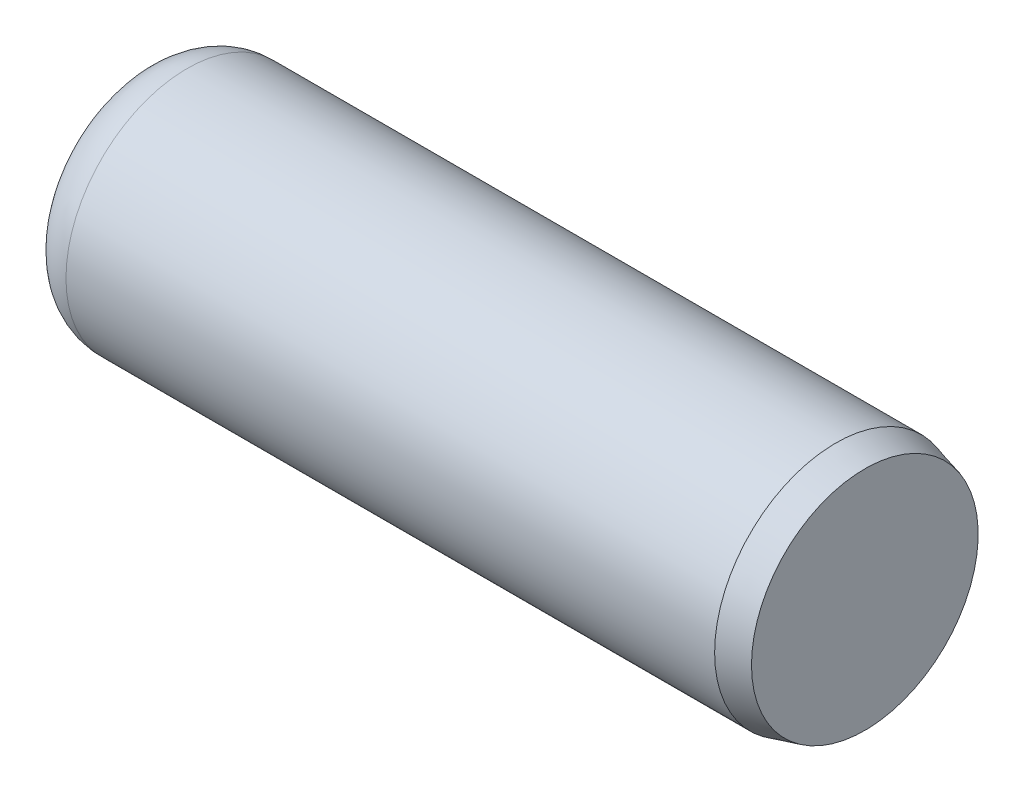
ISO-10303-21;
HEADER;
FILE_DESCRIPTION(('STEP AP214'),'2;1');
FILE_NAME('part.step','',(''),(''),'','','');
FILE_SCHEMA(('AUTOMOTIVE_DESIGN { 1 0 10303 214 1 1 1 1 }'));
ENDSEC;
DATA;
#1=APPLICATION_CONTEXT('core data for automotive mechanical design processes');
#2=APPLICATION_PROTOCOL_DEFINITION('international standard','automotive_design',2000,#1);
#3=PRODUCT_CONTEXT('',#1,'mechanical');
#4=PRODUCT('Part','Part','',(#3));
#5=PRODUCT_RELATED_PRODUCT_CATEGORY('part','',(#4));
#6=PRODUCT_DEFINITION_FORMATION('','',#4);
#7=PRODUCT_DEFINITION_CONTEXT('part definition',#1,'design');
#8=PRODUCT_DEFINITION('design','',#6,#7);
#9=PRODUCT_DEFINITION_SHAPE('','',#8);
#10=(LENGTH_UNIT() NAMED_UNIT(*) SI_UNIT(.MILLI.,.METRE.));
#11=(NAMED_UNIT(*) PLANE_ANGLE_UNIT() SI_UNIT($,.RADIAN.));
#12=(NAMED_UNIT(*) SI_UNIT($,.STERADIAN.) SOLID_ANGLE_UNIT());
#13=UNCERTAINTY_MEASURE_WITH_UNIT(LENGTH_MEASURE(1.E-05),#10,'distance_accuracy_value','');
#14=(GEOMETRIC_REPRESENTATION_CONTEXT(3) GLOBAL_UNCERTAINTY_ASSIGNED_CONTEXT((#13)) GLOBAL_UNIT_ASSIGNED_CONTEXT((#10,
#11,#12)) REPRESENTATION_CONTEXT('',''));
#15=CARTESIAN_POINT('',(0.,0.,0.));
#16=DIRECTION('',(0.,0.,1.));
#17=DIRECTION('',(1.,0.,0.));
#18=AXIS2_PLACEMENT_3D('',#15,#16,#17);
#19=CARTESIAN_POINT('',(0.,1.906524,0.));
#20=DIRECTION('',(1.,0.,0.));
#21=DIRECTION('',(0.,0.,-1.));
#22=AXIS2_PLACEMENT_3D('',#19,#20,#21);
#23=PLANE('',#22);
#24=CARTESIAN_POINT('',(0.,0.,0.));
#25=DIRECTION('',(-1.,0.,0.));
#26=DIRECTION('',(0.,0.,1.));
#27=AXIS2_PLACEMENT_3D('',#24,#25,#26);
#28=CIRCLE('',#27,1.906524);
#29=CARTESIAN_POINT('',(0.,0.,1.906524));
#30=VERTEX_POINT('',#29);
#31=EDGE_CURVE('E46',#30,#30,#28,.T.);
#32=ORIENTED_EDGE('',*,*,#31,.T.);
#33=EDGE_LOOP('',(#32));
#34=FACE_BOUND('',#33,.T.);
#35=ADVANCED_FACE('F32',(#34),#23,.F.);
#36=CARTESIAN_POINT('',(19.05,0.,0.));
#37=DIRECTION('',(-1.,0.,0.));
#38=DIRECTION('',(0.,0.,1.));
#39=AXIS2_PLACEMENT_3D('',#36,#37,#38);
#40=PLANE('',#39);
#41=CARTESIAN_POINT('',(19.05,0.,0.));
#42=DIRECTION('',(-1.,0.,0.));
#43=DIRECTION('',(0.,0.,1.));
#44=AXIS2_PLACEMENT_3D('',#41,#42,#43);
#45=CIRCLE('',#44,2.97319937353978);
#46=CARTESIAN_POINT('',(19.05,0.,2.97319937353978));
#47=VERTEX_POINT('',#46);
#48=EDGE_CURVE('E10',#47,#47,#45,.T.);
#49=ORIENTED_EDGE('',*,*,#48,.F.);
#50=EDGE_LOOP('',(#49));
#51=FACE_BOUND('',#50,.T.);
#52=ADVANCED_FACE('F66',(#51),#40,.F.);
#53=CARTESIAN_POINT('',(19.05,0.,0.));
#54=DIRECTION('',(-1.,0.,0.));
#55=DIRECTION('',(0.,0.,1.));
#56=AXIS2_PLACEMENT_3D('',#53,#54,#55);
#57=CONICAL_SURFACE('',#56,2.97319937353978,0.261799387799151);
#58=CARTESIAN_POINT('',(18.2873904,0.,0.));
#59=DIRECTION('',(-1.,0.,0.));
#60=DIRECTION('',(0.,0.,1.));
#61=AXIS2_PLACEMENT_3D('',#58,#59,#60);
#62=CIRCLE('',#61,3.17754);
#63=CARTESIAN_POINT('',(18.2873904,0.,3.17754));
#64=VERTEX_POINT('',#63);
#65=EDGE_CURVE('E38',#64,#64,#62,.T.);
#66=ORIENTED_EDGE('',*,*,#65,.F.);
#67=EDGE_LOOP('',(#66));
#68=FACE_BOUND('',#67,.T.);
#69=ORIENTED_EDGE('',*,*,#48,.T.);
#70=EDGE_LOOP('',(#69));
#71=FACE_BOUND('',#70,.T.);
#72=ADVANCED_FACE('F61',(#68,#71),#57,.T.);
#73=CARTESIAN_POINT('',(-6.35,0.,0.));
#74=DIRECTION('',(-1.,0.,0.));
#75=DIRECTION('',(0.,0.,1.));
#76=AXIS2_PLACEMENT_3D('',#73,#74,#75);
#77=CYLINDRICAL_SURFACE('',#76,3.17754);
#78=CARTESIAN_POINT('',(1.271016,0.,0.));
#79=DIRECTION('',(-1.,0.,0.));
#80=DIRECTION('',(0.,0.,1.));
#81=AXIS2_PLACEMENT_3D('',#78,#79,#80);
#82=CIRCLE('',#81,3.17754);
#83=CARTESIAN_POINT('',(1.271016,0.,3.17754));
#84=VERTEX_POINT('',#83);
#85=EDGE_CURVE('E42',#84,#84,#82,.T.);
#86=ORIENTED_EDGE('',*,*,#85,.F.);
#87=EDGE_LOOP('',(#86));
#88=FACE_BOUND('',#87,.T.);
#89=ORIENTED_EDGE('',*,*,#65,.T.);
#90=EDGE_LOOP('',(#89));
#91=FACE_BOUND('',#90,.T.);
#92=ADVANCED_FACE('F56',(#88,#91),#77,.T.);
#93=CARTESIAN_POINT('',(1.271016,0.,0.));
#94=DIRECTION('',(-1.,0.,0.));
#95=DIRECTION('',(0.,0.,1.));
#96=AXIS2_PLACEMENT_3D('',#93,#94,#95);
#97=TOROIDAL_SURFACE('',#96,1.906524,1.271016);
#98=ORIENTED_EDGE('',*,*,#31,.F.);
#99=EDGE_LOOP('',(#98));
#100=FACE_BOUND('',#99,.T.);
#101=ORIENTED_EDGE('',*,*,#85,.T.);
#102=EDGE_LOOP('',(#101));
#103=FACE_BOUND('',#102,.T.);
#104=ADVANCED_FACE('F53',(#100,#103),#97,.T.);
#105=CLOSED_SHELL('',(#35,#52,#72,#92,#104));
#106=MANIFOLD_SOLID_BREP('B2',#105);
#107=ADVANCED_BREP_SHAPE_REPRESENTATION('',(#18,#106),#14);
#108=SHAPE_DEFINITION_REPRESENTATION(#9,#107);
ENDSEC;
END-ISO-10303-21;
